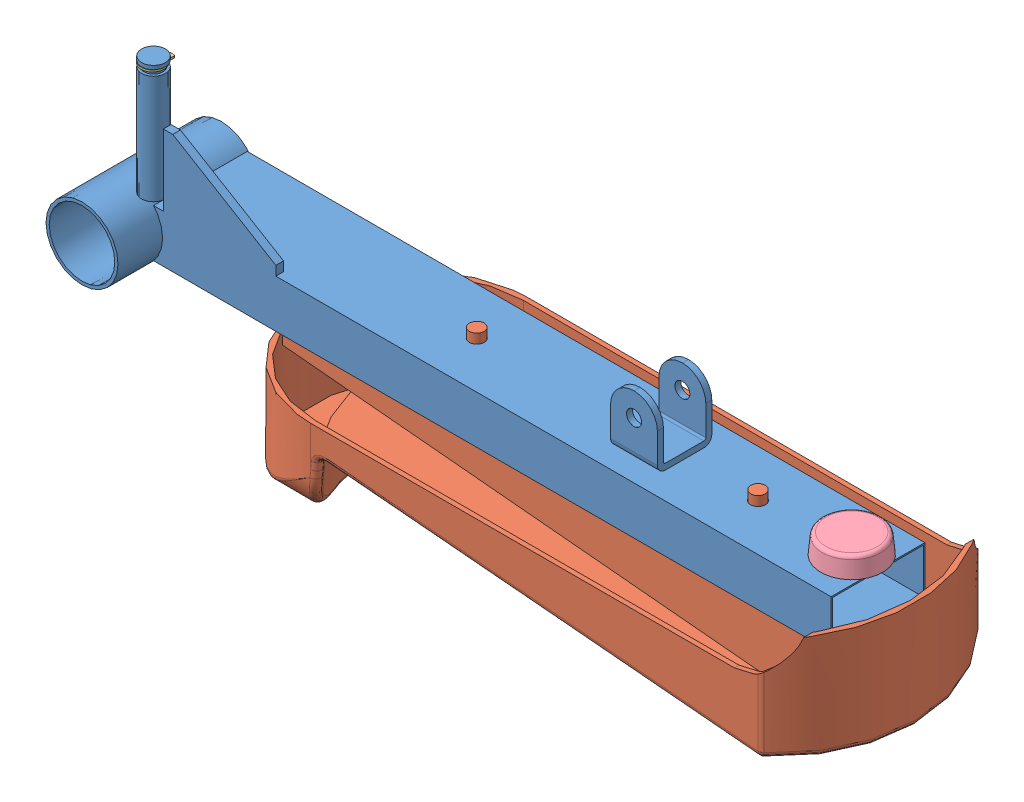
SolidWorks assembly Ensemble_pédale gauche.SLDASM, configuration Défaut (file format 14000). Lengths in mm.
Overall size (411.82 146.67 117.89).
4 component instances, 4 part files, 7 mates.
Components (placement in the parent):
- Support_gauche-1: Support_gauche.SLDPRT [Défaut] at (-175.1207 0.0824 -37.15) size (395 99.95 74.3)
- Repose_pied-1: Repose_pied.SLDPRT [Défaut] at (-17.7993 4.3324 28.5163) x (-1 0 0) z (0 -1 0) size (322.56 117.89 83.67)
- DIN_RETEXT_10 x 1_1-1: DIN_RETEXT_10 x 1_1.SLDPRT [Défaut] at (-161.9707 78.8324 12.15) x (1 0 0) z (0 -1 0) size (12.22 14.66 1)
- Amortisseur_17-1: Amortisseur_17.SLDPRT [Défaut] at (186.6793 12.3324 -11.65) x (0 -1 0) z (0 0 1) size (20 33 33)
Mates (geometry in assembly coordinates):
- Coaxial1: concentric anti-aligned: cylinder of Support_gauche-1 through (-161.9707 78.8324 12.15) axis (0 -1 0) radius 5; cylinder of DIN_RETEXT_10 x 1_1-1 through (-161.9707 77.8324 12.15) axis (0 1 0) radius 4.8
- Coïncidente1: coincident anti-aligned: plane of Support_gauche-1 through (-161.9707 78.8324 12.15) normal (0 -1 0); plane of DIN_RETEXT_10 x 1_1-1 through (-161.9707 78.8324 12.15) normal (0 1 0)
- Coaxial2: concentric anti-aligned: cylinder of Support_gauche-1 through (186.6793 -19.1186 -11.65) axis (0 1 0) radius 5.2; cylinder of Amortisseur_17-1 through (186.6793 -44.6676 -11.65) axis (0 -1 0) radius 4
- Coïncidente2: coincident anti-aligned: plane of Support_gauche-1 through (-194.3217 12.8324 -36.65) normal (0 1 0); plane of Amortisseur_17-1 through (203.1793 12.8324 -11.65) normal (0 -1 0)
- Parallèle1: parallel aligned: plane of Support_gauche-1 through (-194.3217 12.8324 -36.65) normal (0 0 -1); plane of Repose_pied-1 through (193.2007 -65.6676 -72.4837) normal (0 0 -1)
- Coïncidente3: coincident: cylinder of Support_gauche-1 through (-13.3207 -19.1186 -11.65) axis (0 1 0) radius 4; point of Repose_pied-1
- Coïncidente4: coincident anti-aligned: plane of Support_gauche-1 through (-194.3217 -12.6676 -36.65) normal (0 -1 0); plane of Repose_pied-1 through (-97.9657 -12.6676 6.0163) normal (0 1 0)
